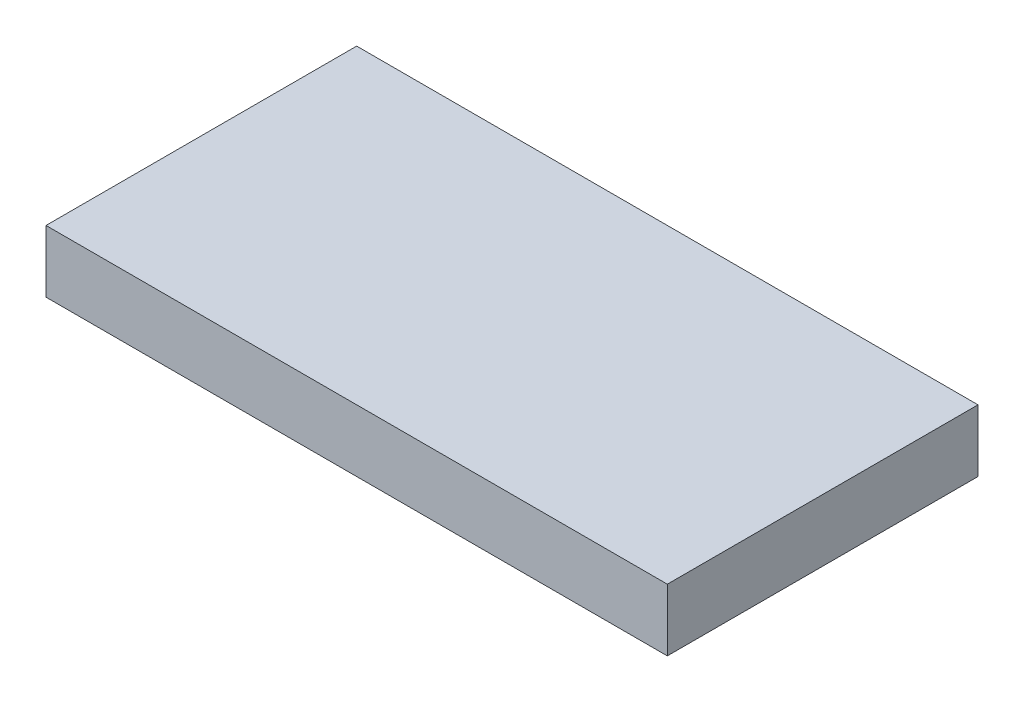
from build123d import *

# Parameters (mm, degrees)
SKETCH1_W           = 100
SKETCH1_H           = 50
BOSS_EXTRUDE1_DEPTH = 10


with BuildPart() as part:
    # Sketch1 → Boss-Extrude1 (new body)
    with BuildSketch(Plane(origin=(0, 0, 0), x_dir=(1, 0, 0), z_dir=(0, 1, 0))):
        with Locations((50, 25)):
            Rectangle(SKETCH1_W, SKETCH1_H)
    extrude(amount=BOSS_EXTRUDE1_DEPTH)


solid = part.part
